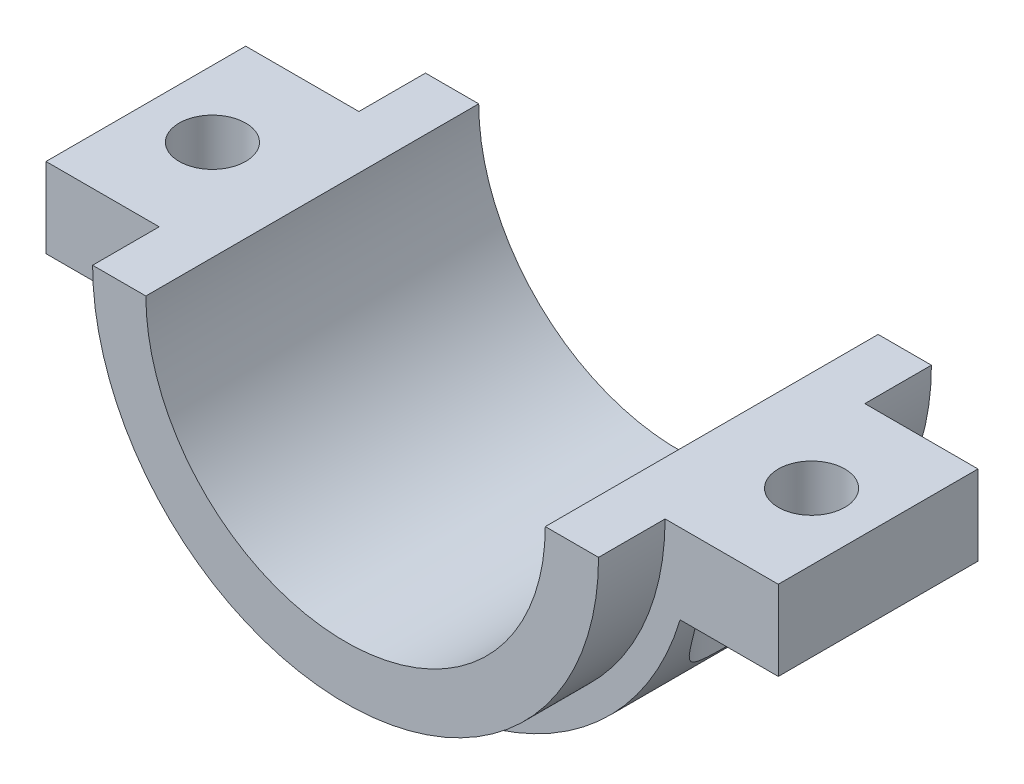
ISO-10303-21;
HEADER;
FILE_DESCRIPTION(('STEP AP214'),'2;1');
FILE_NAME('part.step','',(''),(''),'','','');
FILE_SCHEMA(('AUTOMOTIVE_DESIGN { 1 0 10303 214 1 1 1 1 }'));
ENDSEC;
DATA;
#1=APPLICATION_CONTEXT('core data for automotive mechanical design processes');
#2=APPLICATION_PROTOCOL_DEFINITION('international standard','automotive_design',2000,#1);
#3=PRODUCT_CONTEXT('',#1,'mechanical');
#4=PRODUCT('Part','Part','',(#3));
#5=PRODUCT_RELATED_PRODUCT_CATEGORY('part','',(#4));
#6=PRODUCT_DEFINITION_FORMATION('','',#4);
#7=PRODUCT_DEFINITION_CONTEXT('part definition',#1,'design');
#8=PRODUCT_DEFINITION('design','',#6,#7);
#9=PRODUCT_DEFINITION_SHAPE('','',#8);
#10=(LENGTH_UNIT() NAMED_UNIT(*) SI_UNIT(.MILLI.,.METRE.));
#11=(NAMED_UNIT(*) PLANE_ANGLE_UNIT() SI_UNIT($,.RADIAN.));
#12=(NAMED_UNIT(*) SI_UNIT($,.STERADIAN.) SOLID_ANGLE_UNIT());
#13=UNCERTAINTY_MEASURE_WITH_UNIT(LENGTH_MEASURE(1.E-05),#10,'distance_accuracy_value','');
#14=(GEOMETRIC_REPRESENTATION_CONTEXT(3) GLOBAL_UNCERTAINTY_ASSIGNED_CONTEXT((#13)) GLOBAL_UNIT_ASSIGNED_CONTEXT((#10,
#11,#12)) REPRESENTATION_CONTEXT('',''));
#15=CARTESIAN_POINT('',(0.,0.,0.));
#16=DIRECTION('',(0.,0.,1.));
#17=DIRECTION('',(1.,0.,0.));
#18=AXIS2_PLACEMENT_3D('',#15,#16,#17);
#19=CARTESIAN_POINT('',(-55.,0.,15.));
#20=DIRECTION('',(0.,-1.,0.));
#21=DIRECTION('',(0.,0.,-1.));
#22=AXIS2_PLACEMENT_3D('',#19,#20,#21);
#23=PLANE('',#22);
#24=DIRECTION('',(0.,0.,-1.));
#25=VECTOR('',#24,1.);
#26=CARTESIAN_POINT('',(-30.,0.,15.));
#27=LINE('',#26,#25);
#28=CARTESIAN_POINT('',(-30.,0.,25.));
#29=VERTEX_POINT('',#28);
#30=CARTESIAN_POINT('',(-30.,0.,-25.));
#31=VERTEX_POINT('',#30);
#32=EDGE_CURVE('E52',#29,#31,#27,.T.);
#33=ORIENTED_EDGE('',*,*,#32,.T.);
#34=DIRECTION('',(-1.,0.,0.));
#35=VECTOR('',#34,1.);
#36=CARTESIAN_POINT('',(-38.,0.,-25.));
#37=LINE('',#36,#35);
#38=CARTESIAN_POINT('',(-38.,0.,-25.));
#39=VERTEX_POINT('',#38);
#40=EDGE_CURVE('E190',#31,#39,#37,.T.);
#41=ORIENTED_EDGE('',*,*,#40,.T.);
#42=DIRECTION('',(0.,0.,-1.));
#43=VECTOR('',#42,1.);
#44=CARTESIAN_POINT('',(-38.,0.,25.));
#45=LINE('',#44,#43);
#46=CARTESIAN_POINT('',(-38.,0.,-15.));
#47=VERTEX_POINT('',#46);
#48=EDGE_CURVE('E224',#47,#39,#45,.T.);
#49=ORIENTED_EDGE('',*,*,#48,.F.);
#50=DIRECTION('',(-1.,0.,0.));
#51=VECTOR('',#50,1.);
#52=CARTESIAN_POINT('',(-55.,0.,-15.));
#53=LINE('',#52,#51);
#54=CARTESIAN_POINT('',(-55.,0.,-15.));
#55=VERTEX_POINT('',#54);
#56=EDGE_CURVE('E233',#47,#55,#53,.T.);
#57=ORIENTED_EDGE('',*,*,#56,.T.);
#58=DIRECTION('',(0.,0.,-1.));
#59=VECTOR('',#58,1.);
#60=CARTESIAN_POINT('',(-55.,0.,15.));
#61=LINE('',#60,#59);
#62=CARTESIAN_POINT('',(-55.,0.,15.));
#63=VERTEX_POINT('',#62);
#64=EDGE_CURVE('E179',#63,#55,#61,.T.);
#65=ORIENTED_EDGE('',*,*,#64,.F.);
#66=DIRECTION('',(-1.,0.,0.));
#67=VECTOR('',#66,1.);
#68=CARTESIAN_POINT('',(-55.,0.,15.));
#69=LINE('',#68,#67);
#70=CARTESIAN_POINT('',(-38.,0.,15.));
#71=VERTEX_POINT('',#70);
#72=EDGE_CURVE('E256',#71,#63,#69,.T.);
#73=ORIENTED_EDGE('',*,*,#72,.F.);
#74=CARTESIAN_POINT('',(-38.,0.,25.));
#75=VERTEX_POINT('',#74);
#76=EDGE_CURVE('E219',#75,#71,#45,.T.);
#77=ORIENTED_EDGE('',*,*,#76,.F.);
#78=DIRECTION('',(-1.,0.,0.));
#79=VECTOR('',#78,1.);
#80=CARTESIAN_POINT('',(-38.,0.,25.));
#81=LINE('',#80,#79);
#82=EDGE_CURVE('E193',#29,#75,#81,.T.);
#83=ORIENTED_EDGE('',*,*,#82,.F.);
#84=EDGE_LOOP('',(#33,#41,#49,#57,#65,#73,#77,#83));
#85=FACE_BOUND('',#84,.T.);
#86=CARTESIAN_POINT('',(-45.,0.,0.));
#87=DIRECTION('',(0.,1.,0.));
#88=DIRECTION('',(0.,0.,-1.));
#89=AXIS2_PLACEMENT_3D('',#86,#87,#88);
#90=CIRCLE('',#89,5.);
#91=CARTESIAN_POINT('',(-45.,0.,-5.));
#92=VERTEX_POINT('',#91);
#93=EDGE_CURVE('E149',#92,#92,#90,.T.);
#94=ORIENTED_EDGE('',*,*,#93,.F.);
#95=EDGE_LOOP('',(#94));
#96=FACE_BOUND('',#95,.T.);
#97=ADVANCED_FACE('F43',(#85,#96),#23,.F.);
#98=CARTESIAN_POINT('',(-55.,-12.,15.));
#99=DIRECTION('',(0.,1.,0.));
#100=DIRECTION('',(0.,0.,1.));
#101=AXIS2_PLACEMENT_3D('',#98,#99,#100);
#102=PLANE('',#101);
#103=DIRECTION('',(0.,0.,-1.));
#104=VECTOR('',#103,1.);
#105=CARTESIAN_POINT('',(-55.,-12.,15.));
#106=LINE('',#105,#104);
#107=CARTESIAN_POINT('',(-55.,-12.,15.));
#108=VERTEX_POINT('',#107);
#109=CARTESIAN_POINT('',(-55.,-12.,-15.));
#110=VERTEX_POINT('',#109);
#111=EDGE_CURVE('E172',#108,#110,#106,.T.);
#112=ORIENTED_EDGE('',*,*,#111,.T.);
#113=DIRECTION('',(1.,0.,0.));
#114=VECTOR('',#113,1.);
#115=CARTESIAN_POINT('',(-55.,-12.,-15.));
#116=LINE('',#115,#114);
#117=CARTESIAN_POINT('',(-40.2492235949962,-12.,-15.));
#118=VERTEX_POINT('',#117);
#119=EDGE_CURVE('E164',#110,#118,#116,.T.);
#120=ORIENTED_EDGE('',*,*,#119,.T.);
#121=DIRECTION('',(0.,0.,-1.));
#122=VECTOR('',#121,1.);
#123=CARTESIAN_POINT('',(-40.2492235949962,-12.,15.));
#124=LINE('',#123,#122);
#125=CARTESIAN_POINT('',(-40.2492235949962,-12.,-12.1008315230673));
#126=VERTEX_POINT('',#125);
#127=EDGE_CURVE('E154',#126,#118,#124,.T.);
#128=ORIENTED_EDGE('',*,*,#127,.F.);
#129=CARTESIAN_POINT('',(-45.,-12.,0.));
#130=DIRECTION('',(0.,1.,0.));
#131=DIRECTION('',(0.,0.,-1.));
#132=AXIS2_PLACEMENT_3D('',#129,#130,#131);
#133=CIRCLE('',#132,13.);
#134=CARTESIAN_POINT('',(-40.2492235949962,-12.,12.1008315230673));
#135=VERTEX_POINT('',#134);
#136=EDGE_CURVE('E59',#135,#126,#133,.T.);
#137=ORIENTED_EDGE('',*,*,#136,.F.);
#138=CARTESIAN_POINT('',(-40.2492235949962,-12.,15.));
#139=VERTEX_POINT('',#138);
#140=EDGE_CURVE('E157',#139,#135,#124,.T.);
#141=ORIENTED_EDGE('',*,*,#140,.F.);
#142=DIRECTION('',(1.,0.,0.));
#143=VECTOR('',#142,1.);
#144=CARTESIAN_POINT('',(-55.,-12.,15.));
#145=LINE('',#144,#143);
#146=EDGE_CURVE('E262',#108,#139,#145,.T.);
#147=ORIENTED_EDGE('',*,*,#146,.F.);
#148=EDGE_LOOP('',(#112,#120,#128,#137,#141,#147));
#149=FACE_BOUND('',#148,.T.);
#150=CARTESIAN_POINT('',(-45.,-12.,0.));
#151=DIRECTION('',(0.,1.,0.));
#152=DIRECTION('',(0.,0.,-1.));
#153=AXIS2_PLACEMENT_3D('',#150,#151,#152);
#154=CIRCLE('',#153,5.);
#155=CARTESIAN_POINT('',(-45.,-12.,-5.));
#156=VERTEX_POINT('',#155);
#157=EDGE_CURVE('E559',#156,#156,#154,.T.);
#158=ORIENTED_EDGE('',*,*,#157,.T.);
#159=EDGE_LOOP('',(#158));
#160=FACE_BOUND('',#159,.T.);
#161=ADVANCED_FACE('F161',(#149,#160),#102,.F.);
#162=CARTESIAN_POINT('',(0.,0.,15.));
#163=DIRECTION('',(0.,0.,-1.));
#164=DIRECTION('',(-1.,0.,0.));
#165=AXIS2_PLACEMENT_3D('',#162,#163,#164);
#166=CYLINDRICAL_SURFACE('',#165,42.);
#167=ORIENTED_EDGE('',*,*,#140,.T.);
#168=CARTESIAN_POINT('',(-40.2492235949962,-12.,12.1008315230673));
#169=CARTESIAN_POINT('',(-40.1309175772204,-12.3968494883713,12.0543503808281));
#170=CARTESIAN_POINT('',(-40.0068464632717,-12.7915229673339,12.0036697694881));
#171=CARTESIAN_POINT('',(-39.747518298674,-13.5759058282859,11.8925006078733));
#172=CARTESIAN_POINT('',(-39.6122579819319,-13.9656137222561,11.8320091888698));
#173=CARTESIAN_POINT('',(-39.3301839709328,-14.7413691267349,11.6994678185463));
#174=CARTESIAN_POINT('',(-39.1833102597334,-15.1273842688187,11.6273555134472));
#175=CARTESIAN_POINT('',(-38.8792223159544,-15.8926255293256,11.4701956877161));
#176=CARTESIAN_POINT('',(-38.7220090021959,-16.271852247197,11.3851493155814));
#177=CARTESIAN_POINT('',(-38.3953697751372,-17.0284470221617,11.1988733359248));
#178=CARTESIAN_POINT('',(-38.2257905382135,-17.4056917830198,11.0974099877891));
#179=CARTESIAN_POINT('',(-37.8775953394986,-18.1509483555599,10.8772143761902));
#180=CARTESIAN_POINT('',(-37.6989783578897,-18.5189591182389,10.7584801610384));
#181=CARTESIAN_POINT('',(-37.3344196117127,-19.2433129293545,10.5018308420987));
#182=CARTESIAN_POINT('',(-37.1484969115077,-19.599682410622,10.3639635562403));
#183=CARTESIAN_POINT('',(-36.7705803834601,-20.2998164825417,10.0665020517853));
#184=CARTESIAN_POINT('',(-36.5785886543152,-20.6435853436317,9.90691528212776));
#185=CARTESIAN_POINT('',(-36.2204090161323,-21.2647608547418,9.58993351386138));
#186=CARTESIAN_POINT('',(-36.0547910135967,-21.5442458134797,9.43597223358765));
#187=CARTESIAN_POINT('',(-35.7222466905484,-22.091254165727,9.10920625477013));
#188=CARTESIAN_POINT('',(-35.5553202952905,-22.3587768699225,8.93640047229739));
#189=CARTESIAN_POINT('',(-35.222568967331,-22.8793750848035,8.57103964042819));
#190=CARTESIAN_POINT('',(-35.0567422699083,-23.1324881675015,8.37853999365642));
#191=CARTESIAN_POINT('',(-34.7280540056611,-23.6230698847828,7.97216452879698));
#192=CARTESIAN_POINT('',(-34.5651923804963,-23.8605388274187,7.75828913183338));
#193=CARTESIAN_POINT('',(-34.242873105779,-24.3208905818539,7.3049750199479));
#194=CARTESIAN_POINT('',(-34.0834981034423,-24.5435144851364,7.06521288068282));
#195=CARTESIAN_POINT('',(-33.7739183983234,-24.9678077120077,6.56218584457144));
#196=CARTESIAN_POINT('',(-33.6237146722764,-25.1694748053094,6.29891845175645));
#197=CARTESIAN_POINT('',(-33.3364418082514,-25.5487412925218,5.74955078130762));
#198=CARTESIAN_POINT('',(-33.1993524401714,-25.7263779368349,5.46348696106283));
#199=CARTESIAN_POINT('',(-32.9420563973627,-26.0550283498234,4.86935523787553));
#200=CARTESIAN_POINT('',(-32.8218410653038,-26.206055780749,4.5612987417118));
#201=CARTESIAN_POINT('',(-32.6365331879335,-26.4361725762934,4.02471038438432));
#202=CARTESIAN_POINT('',(-32.5659450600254,-26.5230044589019,3.80135703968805));
#203=CARTESIAN_POINT('',(-32.4358515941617,-26.6819429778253,3.34635794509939));
#204=CARTESIAN_POINT('',(-32.3763435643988,-26.7540531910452,3.114714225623));
#205=CARTESIAN_POINT('',(-32.2695332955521,-26.882786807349,2.6444905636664));
#206=CARTESIAN_POINT('',(-32.222226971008,-26.9394153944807,2.40591297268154));
#207=CARTESIAN_POINT('',(-32.140727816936,-27.0365982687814,1.92328011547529));
#208=CARTESIAN_POINT('',(-32.1065355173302,-27.077151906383,1.67922462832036));
#209=CARTESIAN_POINT('',(-32.0518873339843,-27.1418187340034,1.18658958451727));
#210=CARTESIAN_POINT('',(-32.0314769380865,-27.1658774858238,0.937997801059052));
#211=CARTESIAN_POINT('',(-32.005012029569,-27.197051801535,0.438989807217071));
#212=CARTESIAN_POINT('',(-31.9989574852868,-27.2041674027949,0.188573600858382));
#213=CARTESIAN_POINT('',(-32.0013358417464,-27.2013695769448,-0.312076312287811));
#214=CARTESIAN_POINT('',(-32.009767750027,-27.1914573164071,-0.562310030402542));
#215=CARTESIAN_POINT('',(-32.0409340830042,-27.1547255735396,-1.06062701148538));
#216=CARTESIAN_POINT('',(-32.0636680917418,-27.1279065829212,-1.3087103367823));
#217=CARTESIAN_POINT('',(-32.1214429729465,-27.0594676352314,-1.78833114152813));
#218=CARTESIAN_POINT('',(-32.1558004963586,-27.0186681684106,-2.02006923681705));
#219=CARTESIAN_POINT('',(-32.2363159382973,-26.92255299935,-2.47840820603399));
#220=CARTESIAN_POINT('',(-32.282473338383,-26.8672379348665,-2.70500930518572));
#221=CARTESIAN_POINT('',(-32.3857571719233,-26.7426488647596,-3.15173505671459));
#222=CARTESIAN_POINT('',(-32.442882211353,-26.6733766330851,-3.37186052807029));
#223=CARTESIAN_POINT('',(-32.5671588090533,-26.5214968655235,-3.80462539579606));
#224=CARTESIAN_POINT('',(-32.6343140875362,-26.4388843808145,-4.01726197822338));
#225=CARTESIAN_POINT('',(-32.7818239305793,-26.2557920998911,-4.44641915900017));
#226=CARTESIAN_POINT('',(-32.8627245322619,-26.1545440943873,-4.66242449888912));
#227=CARTESIAN_POINT('',(-33.0332569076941,-25.9388300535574,-5.08417948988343));
#228=CARTESIAN_POINT('',(-33.1228920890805,-25.824358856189,-5.28992509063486));
#229=CARTESIAN_POINT('',(-33.4029039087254,-25.462493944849,-5.89087373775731));
#230=CARTESIAN_POINT('',(-33.6044530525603,-25.1965679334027,-6.26997592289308));
#231=CARTESIAN_POINT('',(-33.9762542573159,-24.6918579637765,-6.89759313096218));
#232=CARTESIAN_POINT('',(-34.1425010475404,-24.4617348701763,-7.15568508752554));
#233=CARTESIAN_POINT('',(-34.4822895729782,-23.9803760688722,-7.64635612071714));
#234=CARTESIAN_POINT('',(-34.6558343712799,-23.7291314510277,-7.87892433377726));
#235=CARTESIAN_POINT('',(-35.0069944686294,-23.2079570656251,-8.31982468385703));
#236=CARTESIAN_POINT('',(-35.184616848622,-22.9379928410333,-8.52811012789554));
#237=CARTESIAN_POINT('',(-35.540711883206,-22.3822882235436,-8.92144710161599));
#238=CARTESIAN_POINT('',(-35.719184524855,-22.0965480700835,-9.10649898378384));
#239=CARTESIAN_POINT('',(-36.1676144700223,-21.3582539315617,-9.54635695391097));
#240=CARTESIAN_POINT('',(-36.4365844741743,-20.896637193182,-9.78700619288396));
#241=CARTESIAN_POINT('',(-36.9645825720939,-19.9478076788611,-10.2249588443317));
#242=CARTESIAN_POINT('',(-37.2236045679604,-19.4605796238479,-10.4222360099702));
#243=CARTESIAN_POINT('',(-37.7276625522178,-18.4644458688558,-10.780019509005));
#244=CARTESIAN_POINT('',(-37.9726662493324,-17.9554944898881,-10.9404433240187));
#245=CARTESIAN_POINT('',(-38.4448252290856,-16.9209588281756,-11.2297046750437));
#246=CARTESIAN_POINT('',(-38.6719856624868,-16.3953794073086,-11.3585513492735));
#247=CARTESIAN_POINT('',(-39.14591189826,-15.2334949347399,-11.6109593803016));
#248=CARTESIAN_POINT('',(-39.3887267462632,-14.5944403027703,-11.729295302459));
#249=CARTESIAN_POINT('',(-39.7294482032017,-13.6267044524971,-11.884301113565));
#250=CARTESIAN_POINT('',(-39.8387770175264,-13.3037000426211,-11.9320968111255));
#251=CARTESIAN_POINT('',(-40.0497825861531,-12.6543053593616,-12.0211654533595));
#252=CARTESIAN_POINT('',(-40.1514592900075,-12.3279150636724,-12.0624383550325));
#253=CARTESIAN_POINT('',(-40.2492235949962,-12.,-12.1008315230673));
#254=B_SPLINE_CURVE_WITH_KNOTS('',3,(#168,#169,#170,#171,#172,#173,#174,#175,#176,#177,#178,
#179,#180,#181,#182,#183,#184,#185,#186,#187,#188,#189,#190,#191,#192,#193,#194,#195,#196,#197,
#198,#199,#200,#201,#202,#203,#204,#205,#206,#207,#208,#209,#210,#211,#212,#213,#214,#215,#216,
#217,#218,#219,#220,#221,#222,#223,#224,#225,#226,#227,#228,#229,#230,#231,#232,#233,#234,#235,
#236,#237,#238,#239,#240,#241,#242,#243,#244,#245,#246,#247,#248,#249,#250,#251,#252,#253),
.UNSPECIFIED.,.F.,.F.,(4,2,2,2,2,2,2,2,2,2,2,2,2,2,2,2,2,2,2,2,2,2,2,2,2,2,2,2,2,2,2,2,2,2,2,2,
2,2,2,2,2,2,4),(0.,1.25010931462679,2.50058482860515,3.75800820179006,5.01531998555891,
6.29242991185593,7.56968426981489,8.84380211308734,10.1174840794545,11.1953857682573,
12.2733494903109,13.3483599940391,14.4233493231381,15.5137997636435,16.6043661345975,
17.6932221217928,18.7815174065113,19.5302379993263,20.2787764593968,21.0270639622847,
21.7753816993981,22.5261573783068,23.276931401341,24.0276539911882,24.7783547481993,
25.4909459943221,26.2035059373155,26.9159753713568,27.6287097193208,28.3836371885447,
29.1388603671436,30.6486691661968,31.798270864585,32.9483599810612,34.1006253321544,
35.2528731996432,37.007944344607,38.764074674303,40.5240996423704,42.2836146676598,
44.3632126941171,45.3960974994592,46.4289891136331),.UNSPECIFIED.);
#255=EDGE_CURVE('E146',#135,#126,#254,.T.);
#256=ORIENTED_EDGE('',*,*,#255,.T.);
#257=ORIENTED_EDGE('',*,*,#127,.T.);
#258=CARTESIAN_POINT('',(0.,0.,-15.));
#259=DIRECTION('',(0.,0.,1.));
#260=DIRECTION('',(1.,0.,0.));
#261=AXIS2_PLACEMENT_3D('',#258,#259,#260);
#262=CIRCLE('',#261,42.);
#263=CARTESIAN_POINT('',(40.2492235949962,-12.,-15.));
#264=VERTEX_POINT('',#263);
#265=EDGE_CURVE('E242',#118,#264,#262,.T.);
#266=ORIENTED_EDGE('',*,*,#265,.T.);
#267=DIRECTION('',(0.,0.,-1.));
#268=VECTOR('',#267,1.);
#269=CARTESIAN_POINT('',(40.2492235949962,-12.,15.));
#270=LINE('',#269,#268);
#271=CARTESIAN_POINT('',(40.2492235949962,-12.,-12.1008315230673));
#272=VERTEX_POINT('',#271);
#273=EDGE_CURVE('E173',#272,#264,#270,.T.);
#274=ORIENTED_EDGE('',*,*,#273,.F.);
#275=CARTESIAN_POINT('',(40.2492235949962,-12.,12.1008315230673));
#276=CARTESIAN_POINT('',(40.1309175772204,-12.3968494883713,12.0543503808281));
#277=CARTESIAN_POINT('',(40.0068464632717,-12.7915229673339,12.0036697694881));
#278=CARTESIAN_POINT('',(39.747518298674,-13.5759058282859,11.8925006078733));
#279=CARTESIAN_POINT('',(39.6122579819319,-13.9656137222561,11.8320091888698));
#280=CARTESIAN_POINT('',(39.3301839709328,-14.7413691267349,11.6994678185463));
#281=CARTESIAN_POINT('',(39.1833102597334,-15.1273842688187,11.6273555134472));
#282=CARTESIAN_POINT('',(38.8792223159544,-15.8926255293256,11.4701956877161));
#283=CARTESIAN_POINT('',(38.7220090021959,-16.271852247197,11.3851493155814));
#284=CARTESIAN_POINT('',(38.3953697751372,-17.0284470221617,11.1988733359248));
#285=CARTESIAN_POINT('',(38.2257905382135,-17.4056917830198,11.0974099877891));
#286=CARTESIAN_POINT('',(37.8775953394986,-18.1509483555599,10.8772143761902));
#287=CARTESIAN_POINT('',(37.6989783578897,-18.5189591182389,10.7584801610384));
#288=CARTESIAN_POINT('',(37.3344196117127,-19.2433129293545,10.5018308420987));
#289=CARTESIAN_POINT('',(37.1484969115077,-19.599682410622,10.3639635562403));
#290=CARTESIAN_POINT('',(36.7705803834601,-20.2998164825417,10.0665020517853));
#291=CARTESIAN_POINT('',(36.5785886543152,-20.6435853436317,9.90691528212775));
#292=CARTESIAN_POINT('',(36.2204090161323,-21.2647608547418,9.58993351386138));
#293=CARTESIAN_POINT('',(36.0547910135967,-21.5442458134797,9.43597223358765));
#294=CARTESIAN_POINT('',(35.7222466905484,-22.091254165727,9.10920625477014));
#295=CARTESIAN_POINT('',(35.5553202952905,-22.3587768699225,8.93640047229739));
#296=CARTESIAN_POINT('',(35.222568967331,-22.8793750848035,8.57103964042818));
#297=CARTESIAN_POINT('',(35.0567422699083,-23.1324881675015,8.37853999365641));
#298=CARTESIAN_POINT('',(34.7280540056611,-23.6230698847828,7.97216452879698));
#299=CARTESIAN_POINT('',(34.5651923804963,-23.8605388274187,7.75828913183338));
#300=CARTESIAN_POINT('',(34.242873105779,-24.3208905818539,7.3049750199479));
#301=CARTESIAN_POINT('',(34.0834981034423,-24.5435144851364,7.06521288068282));
#302=CARTESIAN_POINT('',(33.7739183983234,-24.9678077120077,6.56218584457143));
#303=CARTESIAN_POINT('',(33.6237146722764,-25.1694748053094,6.29891845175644));
#304=CARTESIAN_POINT('',(33.3364418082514,-25.5487412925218,5.74955078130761));
#305=CARTESIAN_POINT('',(33.1993524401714,-25.7263779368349,5.46348696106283));
#306=CARTESIAN_POINT('',(32.9420563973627,-26.0550283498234,4.86935523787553));
#307=CARTESIAN_POINT('',(32.8218410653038,-26.206055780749,4.56129874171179));
#308=CARTESIAN_POINT('',(32.6365331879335,-26.4361725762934,4.02471038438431));
#309=CARTESIAN_POINT('',(32.5659450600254,-26.5230044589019,3.80135703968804));
#310=CARTESIAN_POINT('',(32.4358515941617,-26.6819429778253,3.34635794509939));
#311=CARTESIAN_POINT('',(32.3763435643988,-26.7540531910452,3.114714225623));
#312=CARTESIAN_POINT('',(32.2695332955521,-26.882786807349,2.64449056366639));
#313=CARTESIAN_POINT('',(32.222226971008,-26.9394153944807,2.40591297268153));
#314=CARTESIAN_POINT('',(32.140727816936,-27.0365982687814,1.92328011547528));
#315=CARTESIAN_POINT('',(32.1065355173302,-27.077151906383,1.67922462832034));
#316=CARTESIAN_POINT('',(32.0518873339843,-27.1418187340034,1.18658958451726));
#317=CARTESIAN_POINT('',(32.0314769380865,-27.1658774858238,0.937997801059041));
#318=CARTESIAN_POINT('',(32.005012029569,-27.197051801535,0.43898980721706));
#319=CARTESIAN_POINT('',(31.9989574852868,-27.2041674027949,0.188573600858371));
#320=CARTESIAN_POINT('',(32.0013358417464,-27.2013695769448,-0.312076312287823));
#321=CARTESIAN_POINT('',(32.009767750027,-27.1914573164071,-0.562310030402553));
#322=CARTESIAN_POINT('',(32.0409340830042,-27.1547255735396,-1.06062701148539));
#323=CARTESIAN_POINT('',(32.0636680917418,-27.1279065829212,-1.30871033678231));
#324=CARTESIAN_POINT('',(32.1214429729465,-27.0594676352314,-1.78833114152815));
#325=CARTESIAN_POINT('',(32.1558004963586,-27.0186681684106,-2.02006923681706));
#326=CARTESIAN_POINT('',(32.2363159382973,-26.92255299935,-2.478408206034));
#327=CARTESIAN_POINT('',(32.282473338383,-26.8672379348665,-2.70500930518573));
#328=CARTESIAN_POINT('',(32.3857571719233,-26.7426488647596,-3.15173505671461));
#329=CARTESIAN_POINT('',(32.442882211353,-26.6733766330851,-3.37186052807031));
#330=CARTESIAN_POINT('',(32.5671588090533,-26.5214968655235,-3.80462539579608));
#331=CARTESIAN_POINT('',(32.6343140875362,-26.4388843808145,-4.01726197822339));
#332=CARTESIAN_POINT('',(32.7818239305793,-26.2557920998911,-4.44641915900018));
#333=CARTESIAN_POINT('',(32.8627245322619,-26.1545440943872,-4.66242449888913));
#334=CARTESIAN_POINT('',(33.0332569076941,-25.9388300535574,-5.08417948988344));
#335=CARTESIAN_POINT('',(33.1228920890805,-25.824358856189,-5.28992509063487));
#336=CARTESIAN_POINT('',(33.4029039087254,-25.462493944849,-5.89087373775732));
#337=CARTESIAN_POINT('',(33.6044530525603,-25.1965679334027,-6.26997592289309));
#338=CARTESIAN_POINT('',(33.9762542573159,-24.6918579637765,-6.89759313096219));
#339=CARTESIAN_POINT('',(34.1425010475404,-24.4617348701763,-7.15568508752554));
#340=CARTESIAN_POINT('',(34.4822895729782,-23.9803760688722,-7.64635612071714));
#341=CARTESIAN_POINT('',(34.6558343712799,-23.7291314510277,-7.87892433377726));
#342=CARTESIAN_POINT('',(35.0069944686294,-23.2079570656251,-8.31982468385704));
#343=CARTESIAN_POINT('',(35.184616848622,-22.9379928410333,-8.52811012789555));
#344=CARTESIAN_POINT('',(35.540711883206,-22.3822882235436,-8.92144710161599));
#345=CARTESIAN_POINT('',(35.719184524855,-22.0965480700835,-9.10649898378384));
#346=CARTESIAN_POINT('',(36.1676144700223,-21.3582539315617,-9.54635695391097));
#347=CARTESIAN_POINT('',(36.4365844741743,-20.896637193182,-9.78700619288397));
#348=CARTESIAN_POINT('',(36.9645825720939,-19.9478076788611,-10.2249588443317));
#349=CARTESIAN_POINT('',(37.2236045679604,-19.4605796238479,-10.4222360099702));
#350=CARTESIAN_POINT('',(37.7276625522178,-18.4644458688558,-10.780019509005));
#351=CARTESIAN_POINT('',(37.9726662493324,-17.9554944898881,-10.9404433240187));
#352=CARTESIAN_POINT('',(38.4448252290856,-16.9209588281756,-11.2297046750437));
#353=CARTESIAN_POINT('',(38.6719856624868,-16.3953794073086,-11.3585513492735));
#354=CARTESIAN_POINT('',(39.14591189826,-15.2334949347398,-11.6109593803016));
#355=CARTESIAN_POINT('',(39.3887267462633,-14.5944403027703,-11.729295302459));
#356=CARTESIAN_POINT('',(39.7294482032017,-13.6267044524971,-11.884301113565));
#357=CARTESIAN_POINT('',(39.8387770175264,-13.3037000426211,-11.9320968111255));
#358=CARTESIAN_POINT('',(40.0497825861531,-12.6543053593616,-12.0211654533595));
#359=CARTESIAN_POINT('',(40.1514592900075,-12.3279150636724,-12.0624383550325));
#360=CARTESIAN_POINT('',(40.2492235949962,-12.,-12.1008315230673));
#361=B_SPLINE_CURVE_WITH_KNOTS('',3,(#275,#276,#277,#278,#279,#280,#281,#282,#283,#284,#285,
#286,#287,#288,#289,#290,#291,#292,#293,#294,#295,#296,#297,#298,#299,#300,#301,#302,#303,#304,
#305,#306,#307,#308,#309,#310,#311,#312,#313,#314,#315,#316,#317,#318,#319,#320,#321,#322,#323,
#324,#325,#326,#327,#328,#329,#330,#331,#332,#333,#334,#335,#336,#337,#338,#339,#340,#341,#342,
#343,#344,#345,#346,#347,#348,#349,#350,#351,#352,#353,#354,#355,#356,#357,#358,#359,#360),
.UNSPECIFIED.,.F.,.F.,(4,2,2,2,2,2,2,2,2,2,2,2,2,2,2,2,2,2,2,2,2,2,2,2,2,2,2,2,2,2,2,2,2,2,2,2,
2,2,2,2,2,2,4),(0.,1.25010931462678,2.50058482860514,3.75800820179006,5.01531998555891,
6.29242991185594,7.56968426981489,8.84380211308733,10.1174840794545,11.1953857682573,
12.2733494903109,13.3483599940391,14.4233493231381,15.5137997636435,16.6043661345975,
17.6932221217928,18.7815174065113,19.5302379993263,20.2787764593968,21.0270639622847,
21.7753816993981,22.5261573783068,23.276931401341,24.0276539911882,24.7783547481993,
25.4909459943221,26.2035059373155,26.9159753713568,27.6287097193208,28.3836371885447,
29.1388603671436,30.6486691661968,31.798270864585,32.9483599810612,34.1006253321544,
35.2528731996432,37.007944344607,38.7640746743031,40.5240996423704,42.2836146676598,
44.3632126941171,45.3960974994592,46.4289891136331),.UNSPECIFIED.);
#362=CARTESIAN_POINT('',(40.2492235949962,-12.,12.1008315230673));
#363=VERTEX_POINT('',#362);
#364=EDGE_CURVE('E320',#363,#272,#361,.T.);
#365=ORIENTED_EDGE('',*,*,#364,.F.);
#366=CARTESIAN_POINT('',(40.2492235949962,-12.,15.));
#367=VERTEX_POINT('',#366);
#368=EDGE_CURVE('E167',#367,#363,#270,.T.);
#369=ORIENTED_EDGE('',*,*,#368,.F.);
#370=CARTESIAN_POINT('',(0.,0.,15.));
#371=DIRECTION('',(0.,0.,1.));
#372=DIRECTION('',(1.,0.,0.));
#373=AXIS2_PLACEMENT_3D('',#370,#371,#372);
#374=CIRCLE('',#373,42.);
#375=EDGE_CURVE('E265',#139,#367,#374,.T.);
#376=ORIENTED_EDGE('',*,*,#375,.F.);
#377=EDGE_LOOP('',(#167,#256,#257,#266,#274,#365,#369,#376));
#378=FACE_BOUND('',#377,.T.);
#379=ADVANCED_FACE('F152',(#378),#166,.T.);
#380=CARTESIAN_POINT('',(0.,0.,15.));
#381=DIRECTION('',(0.,0.,1.));
#382=DIRECTION('',(1.,0.,0.));
#383=AXIS2_PLACEMENT_3D('',#380,#381,#382);
#384=PLANE('',#383);
#385=DIRECTION('',(-1.,0.,0.));
#386=VECTOR('',#385,1.);
#387=CARTESIAN_POINT('',(30.,0.,15.));
#388=LINE('',#387,#386);
#389=CARTESIAN_POINT('',(55.,0.,15.));
#390=VERTEX_POINT('',#389);
#391=CARTESIAN_POINT('',(38.,0.,15.));
#392=VERTEX_POINT('',#391);
#393=EDGE_CURVE('E274',#390,#392,#388,.T.);
#394=ORIENTED_EDGE('',*,*,#393,.T.);
#395=CARTESIAN_POINT('',(0.,0.,15.));
#396=DIRECTION('',(0.,0.,1.));
#397=DIRECTION('',(1.,0.,0.));
#398=AXIS2_PLACEMENT_3D('',#395,#396,#397);
#399=CIRCLE('',#398,38.);
#400=EDGE_CURVE('E229',#392,#71,#399,.F.);
#401=ORIENTED_EDGE('',*,*,#400,.T.);
#402=ORIENTED_EDGE('',*,*,#72,.T.);
#403=DIRECTION('',(0.,-1.,0.));
#404=VECTOR('',#403,1.);
#405=CARTESIAN_POINT('',(-55.,0.,15.));
#406=LINE('',#405,#404);
#407=EDGE_CURVE('E259',#63,#108,#406,.T.);
#408=ORIENTED_EDGE('',*,*,#407,.T.);
#409=ORIENTED_EDGE('',*,*,#146,.T.);
#410=ORIENTED_EDGE('',*,*,#375,.T.);
#411=DIRECTION('',(1.,0.,0.));
#412=VECTOR('',#411,1.);
#413=CARTESIAN_POINT('',(40.2492235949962,-12.,15.));
#414=LINE('',#413,#412);
#415=CARTESIAN_POINT('',(55.,-12.,15.));
#416=VERTEX_POINT('',#415);
#417=EDGE_CURVE('E268',#367,#416,#414,.T.);
#418=ORIENTED_EDGE('',*,*,#417,.T.);
#419=DIRECTION('',(0.,1.,0.));
#420=VECTOR('',#419,1.);
#421=CARTESIAN_POINT('',(55.,0.,15.));
#422=LINE('',#421,#420);
#423=EDGE_CURVE('E271',#416,#390,#422,.T.);
#424=ORIENTED_EDGE('',*,*,#423,.T.);
#425=EDGE_LOOP('',(#394,#401,#402,#408,#409,#410,#418,#424));
#426=FACE_BOUND('',#425,.T.);
#427=ADVANCED_FACE('F307',(#426),#384,.T.);
#428=CARTESIAN_POINT('',(0.,0.,-15.));
#429=DIRECTION('',(0.,0.,1.));
#430=DIRECTION('',(1.,0.,0.));
#431=AXIS2_PLACEMENT_3D('',#428,#429,#430);
#432=PLANE('',#431);
#433=CARTESIAN_POINT('',(0.,0.,-15.));
#434=DIRECTION('',(0.,0.,1.));
#435=DIRECTION('',(1.,0.,0.));
#436=AXIS2_PLACEMENT_3D('',#433,#434,#435);
#437=CIRCLE('',#436,38.);
#438=CARTESIAN_POINT('',(38.,0.,-15.));
#439=VERTEX_POINT('',#438);
#440=EDGE_CURVE('E11',#439,#47,#437,.F.);
#441=ORIENTED_EDGE('',*,*,#440,.F.);
#442=DIRECTION('',(-1.,0.,0.));
#443=VECTOR('',#442,1.);
#444=CARTESIAN_POINT('',(30.,0.,-15.));
#445=LINE('',#444,#443);
#446=CARTESIAN_POINT('',(55.,0.,-15.));
#447=VERTEX_POINT('',#446);
#448=EDGE_CURVE('E252',#447,#439,#445,.T.);
#449=ORIENTED_EDGE('',*,*,#448,.F.);
#450=DIRECTION('',(0.,1.,0.));
#451=VECTOR('',#450,1.);
#452=CARTESIAN_POINT('',(55.,0.,-15.));
#453=LINE('',#452,#451);
#454=CARTESIAN_POINT('',(55.,-12.,-15.));
#455=VERTEX_POINT('',#454);
#456=EDGE_CURVE('E249',#455,#447,#453,.T.);
#457=ORIENTED_EDGE('',*,*,#456,.F.);
#458=DIRECTION('',(1.,0.,0.));
#459=VECTOR('',#458,1.);
#460=CARTESIAN_POINT('',(40.2492235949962,-12.,-15.));
#461=LINE('',#460,#459);
#462=EDGE_CURVE('E245',#264,#455,#461,.T.);
#463=ORIENTED_EDGE('',*,*,#462,.F.);
#464=ORIENTED_EDGE('',*,*,#265,.F.);
#465=ORIENTED_EDGE('',*,*,#119,.F.);
#466=DIRECTION('',(0.,-1.,0.));
#467=VECTOR('',#466,1.);
#468=CARTESIAN_POINT('',(-55.,0.,-15.));
#469=LINE('',#468,#467);
#470=EDGE_CURVE('E236',#55,#110,#469,.T.);
#471=ORIENTED_EDGE('',*,*,#470,.F.);
#472=ORIENTED_EDGE('',*,*,#56,.F.);
#473=EDGE_LOOP('',(#441,#449,#457,#463,#464,#465,#471,#472));
#474=FACE_BOUND('',#473,.T.);
#475=ADVANCED_FACE('F297',(#474),#432,.F.);
#476=CARTESIAN_POINT('',(0.,0.,15.));
#477=DIRECTION('',(0.,0.,-1.));
#478=DIRECTION('',(-1.,0.,0.));
#479=AXIS2_PLACEMENT_3D('',#476,#477,#478);
#480=CYLINDRICAL_SURFACE('',#479,30.);
#481=DIRECTION('',(0.,0.,-1.));
#482=VECTOR('',#481,1.);
#483=CARTESIAN_POINT('',(30.,0.,15.));
#484=LINE('',#483,#482);
#485=CARTESIAN_POINT('',(30.,0.,25.));
#486=VERTEX_POINT('',#485);
#487=CARTESIAN_POINT('',(30.,0.,-25.));
#488=VERTEX_POINT('',#487);
#489=EDGE_CURVE('E199',#486,#488,#484,.T.);
#490=ORIENTED_EDGE('',*,*,#489,.T.);
#491=CARTESIAN_POINT('',(0.,0.,-25.));
#492=DIRECTION('',(0.,0.,-1.));
#493=DIRECTION('',(1.,0.,0.));
#494=AXIS2_PLACEMENT_3D('',#491,#492,#493);
#495=CIRCLE('',#494,30.);
#496=EDGE_CURVE('E198',#488,#31,#495,.T.);
#497=ORIENTED_EDGE('',*,*,#496,.T.);
#498=ORIENTED_EDGE('',*,*,#32,.F.);
#499=CARTESIAN_POINT('',(0.,0.,25.));
#500=DIRECTION('',(0.,0.,-1.));
#501=DIRECTION('',(1.,0.,0.));
#502=AXIS2_PLACEMENT_3D('',#499,#500,#501);
#503=CIRCLE('',#502,30.);
#504=EDGE_CURVE('E497',#486,#29,#503,.T.);
#505=ORIENTED_EDGE('',*,*,#504,.F.);
#506=EDGE_LOOP('',(#490,#497,#498,#505));
#507=FACE_BOUND('',#506,.T.);
#508=ADVANCED_FACE('F45',(#507),#480,.F.);
#509=CARTESIAN_POINT('',(-55.,0.,15.));
#510=DIRECTION('',(1.,0.,0.));
#511=DIRECTION('',(0.,1.,0.));
#512=AXIS2_PLACEMENT_3D('',#509,#510,#511);
#513=PLANE('',#512);
#514=ORIENTED_EDGE('',*,*,#470,.T.);
#515=ORIENTED_EDGE('',*,*,#111,.F.);
#516=ORIENTED_EDGE('',*,*,#407,.F.);
#517=ORIENTED_EDGE('',*,*,#64,.T.);
#518=EDGE_LOOP('',(#514,#515,#516,#517));
#519=FACE_BOUND('',#518,.T.);
#520=ADVANCED_FACE('F316',(#519),#513,.F.);
#521=CARTESIAN_POINT('',(40.2492235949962,-12.,15.));
#522=DIRECTION('',(0.,1.,0.));
#523=DIRECTION('',(0.,0.,1.));
#524=AXIS2_PLACEMENT_3D('',#521,#522,#523);
#525=PLANE('',#524);
#526=CARTESIAN_POINT('',(45.,-12.,0.));
#527=DIRECTION('',(0.,-1.,0.));
#528=DIRECTION('',(0.,0.,-1.));
#529=AXIS2_PLACEMENT_3D('',#526,#527,#528);
#530=CIRCLE('',#529,5.);
#531=CARTESIAN_POINT('',(45.,-12.,-5.));
#532=VERTEX_POINT('',#531);
#533=EDGE_CURVE('E159',#532,#532,#530,.T.);
#534=ORIENTED_EDGE('',*,*,#533,.F.);
#535=EDGE_LOOP('',(#534));
#536=FACE_BOUND('',#535,.T.);
#537=ORIENTED_EDGE('',*,*,#368,.T.);
#538=CARTESIAN_POINT('',(45.,-12.,0.));
#539=DIRECTION('',(0.,-1.,0.));
#540=DIRECTION('',(0.,0.,-1.));
#541=AXIS2_PLACEMENT_3D('',#538,#539,#540);
#542=CIRCLE('',#541,13.);
#543=EDGE_CURVE('E67',#363,#272,#542,.T.);
#544=ORIENTED_EDGE('',*,*,#543,.T.);
#545=ORIENTED_EDGE('',*,*,#273,.T.);
#546=ORIENTED_EDGE('',*,*,#462,.T.);
#547=DIRECTION('',(0.,0.,-1.));
#548=VECTOR('',#547,1.);
#549=CARTESIAN_POINT('',(55.,-12.,15.));
#550=LINE('',#549,#548);
#551=EDGE_CURVE('E282',#416,#455,#550,.T.);
#552=ORIENTED_EDGE('',*,*,#551,.F.);
#553=ORIENTED_EDGE('',*,*,#417,.F.);
#554=EDGE_LOOP('',(#537,#544,#545,#546,#552,#553));
#555=FACE_BOUND('',#554,.T.);
#556=ADVANCED_FACE('F291',(#536,#555),#525,.F.);
#557=CARTESIAN_POINT('',(55.,0.,15.));
#558=DIRECTION('',(-1.,0.,0.));
#559=DIRECTION('',(0.,-1.,0.));
#560=AXIS2_PLACEMENT_3D('',#557,#558,#559);
#561=PLANE('',#560);
#562=ORIENTED_EDGE('',*,*,#456,.T.);
#563=DIRECTION('',(0.,0.,-1.));
#564=VECTOR('',#563,1.);
#565=CARTESIAN_POINT('',(55.,0.,15.));
#566=LINE('',#565,#564);
#567=EDGE_CURVE('E279',#390,#447,#566,.T.);
#568=ORIENTED_EDGE('',*,*,#567,.F.);
#569=ORIENTED_EDGE('',*,*,#423,.F.);
#570=ORIENTED_EDGE('',*,*,#551,.T.);
#571=EDGE_LOOP('',(#562,#568,#569,#570));
#572=FACE_BOUND('',#571,.T.);
#573=ADVANCED_FACE('F300',(#572),#561,.F.);
#574=CARTESIAN_POINT('',(30.,0.,15.));
#575=DIRECTION('',(0.,-1.,0.));
#576=DIRECTION('',(0.,0.,-1.));
#577=AXIS2_PLACEMENT_3D('',#574,#575,#576);
#578=PLANE('',#577);
#579=CARTESIAN_POINT('',(45.,0.,0.));
#580=DIRECTION('',(0.,-1.,0.));
#581=DIRECTION('',(0.,0.,-1.));
#582=AXIS2_PLACEMENT_3D('',#579,#580,#581);
#583=CIRCLE('',#582,5.);
#584=CARTESIAN_POINT('',(45.,0.,-5.));
#585=VERTEX_POINT('',#584);
#586=EDGE_CURVE('E328',#585,#585,#583,.T.);
#587=ORIENTED_EDGE('',*,*,#586,.T.);
#588=EDGE_LOOP('',(#587));
#589=FACE_BOUND('',#588,.T.);
#590=ORIENTED_EDGE('',*,*,#489,.F.);
#591=DIRECTION('',(-1.,0.,0.));
#592=VECTOR('',#591,1.);
#593=CARTESIAN_POINT('',(30.,0.,25.));
#594=LINE('',#593,#592);
#595=CARTESIAN_POINT('',(38.,0.,25.));
#596=VERTEX_POINT('',#595);
#597=EDGE_CURVE('E215',#596,#486,#594,.T.);
#598=ORIENTED_EDGE('',*,*,#597,.F.);
#599=DIRECTION('',(0.,0.,-1.));
#600=VECTOR('',#599,1.);
#601=CARTESIAN_POINT('',(38.,0.,25.));
#602=LINE('',#601,#600);
#603=EDGE_CURVE('E225',#596,#392,#602,.T.);
#604=ORIENTED_EDGE('',*,*,#603,.T.);
#605=ORIENTED_EDGE('',*,*,#393,.F.);
#606=ORIENTED_EDGE('',*,*,#567,.T.);
#607=ORIENTED_EDGE('',*,*,#448,.T.);
#608=CARTESIAN_POINT('',(38.,0.,-25.));
#609=VERTEX_POINT('',#608);
#610=EDGE_CURVE('E223',#439,#609,#602,.T.);
#611=ORIENTED_EDGE('',*,*,#610,.T.);
#612=DIRECTION('',(-1.,0.,0.));
#613=VECTOR('',#612,1.);
#614=CARTESIAN_POINT('',(30.,0.,-25.));
#615=LINE('',#614,#613);
#616=EDGE_CURVE('E204',#609,#488,#615,.T.);
#617=ORIENTED_EDGE('',*,*,#616,.T.);
#618=EDGE_LOOP('',(#590,#598,#604,#605,#606,#607,#611,#617));
#619=FACE_BOUND('',#618,.T.);
#620=ADVANCED_FACE('F303',(#589,#619),#578,.F.);
#621=CARTESIAN_POINT('',(0.,0.,-25.));
#622=DIRECTION('',(0.,0.,-1.));
#623=DIRECTION('',(-1.,0.,0.));
#624=AXIS2_PLACEMENT_3D('',#621,#622,#623);
#625=PLANE('',#624);
#626=CARTESIAN_POINT('',(0.,0.,-25.));
#627=DIRECTION('',(0.,0.,1.));
#628=DIRECTION('',(-1.,0.,0.));
#629=AXIS2_PLACEMENT_3D('',#626,#627,#628);
#630=CIRCLE('',#629,38.);
#631=EDGE_CURVE('E208',#39,#609,#630,.T.);
#632=ORIENTED_EDGE('',*,*,#631,.F.);
#633=ORIENTED_EDGE('',*,*,#40,.F.);
#634=ORIENTED_EDGE('',*,*,#496,.F.);
#635=ORIENTED_EDGE('',*,*,#616,.F.);
#636=EDGE_LOOP('',(#632,#633,#634,#635));
#637=FACE_BOUND('',#636,.T.);
#638=ADVANCED_FACE('F206',(#637),#625,.T.);
#639=CARTESIAN_POINT('',(0.,0.,25.));
#640=DIRECTION('',(0.,0.,-1.));
#641=DIRECTION('',(-1.,0.,0.));
#642=AXIS2_PLACEMENT_3D('',#639,#640,#641);
#643=CYLINDRICAL_SURFACE('',#642,38.);
#644=ORIENTED_EDGE('',*,*,#610,.F.);
#645=ORIENTED_EDGE('',*,*,#440,.T.);
#646=ORIENTED_EDGE('',*,*,#48,.T.);
#647=ORIENTED_EDGE('',*,*,#631,.T.);
#648=EDGE_LOOP('',(#644,#645,#646,#647));
#649=FACE_BOUND('',#648,.T.);
#650=ADVANCED_FACE('F354',(#649),#643,.T.);
#651=ORIENTED_EDGE('',*,*,#400,.F.);
#652=ORIENTED_EDGE('',*,*,#603,.F.);
#653=CARTESIAN_POINT('',(0.,0.,25.));
#654=DIRECTION('',(0.,0.,1.));
#655=DIRECTION('',(-1.,0.,0.));
#656=AXIS2_PLACEMENT_3D('',#653,#654,#655);
#657=CIRCLE('',#656,38.);
#658=EDGE_CURVE('E210',#75,#596,#657,.T.);
#659=ORIENTED_EDGE('',*,*,#658,.F.);
#660=ORIENTED_EDGE('',*,*,#76,.T.);
#661=EDGE_LOOP('',(#651,#652,#659,#660));
#662=FACE_BOUND('',#661,.T.);
#663=ADVANCED_FACE('F309',(#662),#643,.T.);
#664=CARTESIAN_POINT('',(0.,0.,25.));
#665=DIRECTION('',(0.,0.,-1.));
#666=DIRECTION('',(-1.,0.,0.));
#667=AXIS2_PLACEMENT_3D('',#664,#665,#666);
#668=PLANE('',#667);
#669=ORIENTED_EDGE('',*,*,#658,.T.);
#670=ORIENTED_EDGE('',*,*,#597,.T.);
#671=ORIENTED_EDGE('',*,*,#504,.T.);
#672=ORIENTED_EDGE('',*,*,#82,.T.);
#673=EDGE_LOOP('',(#669,#670,#671,#672));
#674=FACE_BOUND('',#673,.T.);
#675=ADVANCED_FACE('F347',(#674),#668,.F.);
#676=CARTESIAN_POINT('',(45.,-42.,0.));
#677=DIRECTION('',(0.,1.,0.));
#678=DIRECTION('',(0.,0.,1.));
#679=AXIS2_PLACEMENT_3D('',#676,#677,#678);
#680=CYLINDRICAL_SURFACE('',#679,13.);
#681=ORIENTED_EDGE('',*,*,#364,.T.);
#682=ORIENTED_EDGE('',*,*,#543,.F.);
#683=EDGE_LOOP('',(#681,#682));
#684=FACE_BOUND('',#683,.T.);
#685=ADVANCED_FACE('F341',(#684),#680,.F.);
#686=CARTESIAN_POINT('',(45.,0.,0.));
#687=DIRECTION('',(0.,-1.,0.));
#688=DIRECTION('',(0.,0.,-1.));
#689=AXIS2_PLACEMENT_3D('',#686,#687,#688);
#690=CYLINDRICAL_SURFACE('',#689,5.);
#691=ORIENTED_EDGE('',*,*,#586,.F.);
#692=EDGE_LOOP('',(#691));
#693=FACE_BOUND('',#692,.T.);
#694=ORIENTED_EDGE('',*,*,#533,.T.);
#695=EDGE_LOOP('',(#694));
#696=FACE_BOUND('',#695,.T.);
#697=ADVANCED_FACE('F346',(#693,#696),#690,.F.);
#698=CARTESIAN_POINT('',(-45.,-42.,0.));
#699=DIRECTION('',(0.,1.,0.));
#700=DIRECTION('',(0.,0.,1.));
#701=AXIS2_PLACEMENT_3D('',#698,#699,#700);
#702=CYLINDRICAL_SURFACE('',#701,13.);
#703=ORIENTED_EDGE('',*,*,#136,.T.);
#704=ORIENTED_EDGE('',*,*,#255,.F.);
#705=EDGE_LOOP('',(#703,#704));
#706=FACE_BOUND('',#705,.T.);
#707=ADVANCED_FACE('F145',(#706),#702,.F.);
#708=CARTESIAN_POINT('',(-45.,0.,0.));
#709=DIRECTION('',(0.,-1.,0.));
#710=DIRECTION('',(0.,0.,-1.));
#711=AXIS2_PLACEMENT_3D('',#708,#709,#710);
#712=CYLINDRICAL_SURFACE('',#711,5.);
#713=ORIENTED_EDGE('',*,*,#93,.T.);
#714=EDGE_LOOP('',(#713));
#715=FACE_BOUND('',#714,.T.);
#716=ORIENTED_EDGE('',*,*,#157,.F.);
#717=EDGE_LOOP('',(#716));
#718=FACE_BOUND('',#717,.T.);
#719=ADVANCED_FACE('F410',(#715,#718),#712,.F.);
#720=CLOSED_SHELL('',(#97,#161,#379,#427,#475,#508,#520,#556,#573,#620,#638,#650,#663,#675,#685,
#697,#707,#719));
#721=MANIFOLD_SOLID_BREP('B2',#720);
#722=ADVANCED_BREP_SHAPE_REPRESENTATION('',(#18,#721),#14);
#723=SHAPE_DEFINITION_REPRESENTATION(#9,#722);
ENDSEC;
END-ISO-10303-21;
